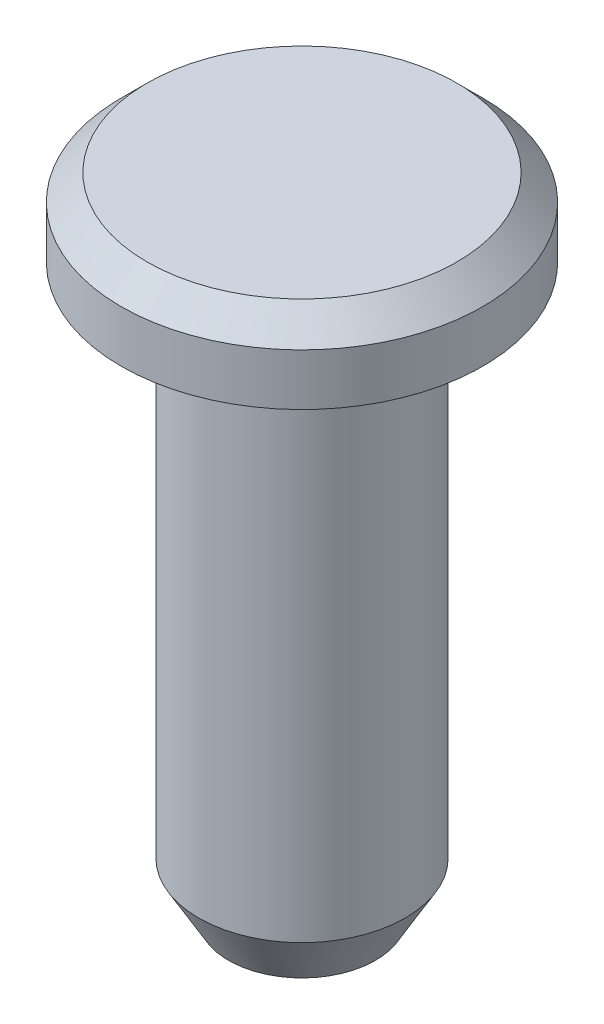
ISO-10303-21;
HEADER;
FILE_DESCRIPTION(('STEP AP214'),'2;1');
FILE_NAME('part.step','',(''),(''),'','','');
FILE_SCHEMA(('AUTOMOTIVE_DESIGN { 1 0 10303 214 1 1 1 1 }'));
ENDSEC;
DATA;
#1=APPLICATION_CONTEXT('core data for automotive mechanical design processes');
#2=APPLICATION_PROTOCOL_DEFINITION('international standard','automotive_design',2000,#1);
#3=PRODUCT_CONTEXT('',#1,'mechanical');
#4=PRODUCT('Part','Part','',(#3));
#5=PRODUCT_RELATED_PRODUCT_CATEGORY('part','',(#4));
#6=PRODUCT_DEFINITION_FORMATION('','',#4);
#7=PRODUCT_DEFINITION_CONTEXT('part definition',#1,'design');
#8=PRODUCT_DEFINITION('design','',#6,#7);
#9=PRODUCT_DEFINITION_SHAPE('','',#8);
#10=(LENGTH_UNIT() NAMED_UNIT(*) SI_UNIT(.MILLI.,.METRE.));
#11=(NAMED_UNIT(*) PLANE_ANGLE_UNIT() SI_UNIT($,.RADIAN.));
#12=(NAMED_UNIT(*) SI_UNIT($,.STERADIAN.) SOLID_ANGLE_UNIT());
#13=UNCERTAINTY_MEASURE_WITH_UNIT(LENGTH_MEASURE(1.E-05),#10,'distance_accuracy_value','');
#14=(GEOMETRIC_REPRESENTATION_CONTEXT(3) GLOBAL_UNCERTAINTY_ASSIGNED_CONTEXT((#13)) GLOBAL_UNIT_ASSIGNED_CONTEXT((#10,
#11,#12)) REPRESENTATION_CONTEXT('',''));
#15=CARTESIAN_POINT('',(0.,0.,0.));
#16=DIRECTION('',(0.,0.,1.));
#17=DIRECTION('',(1.,0.,0.));
#18=AXIS2_PLACEMENT_3D('',#15,#16,#17);
#19=CARTESIAN_POINT('',(0.,0.,0.));
#20=DIRECTION('',(0.,-1.,0.));
#21=DIRECTION('',(0.,0.,-1.));
#22=AXIS2_PLACEMENT_3D('',#19,#20,#21);
#23=PLANE('',#22);
#24=CARTESIAN_POINT('',(0.,0.,0.));
#25=DIRECTION('',(0.,-1.,0.));
#26=DIRECTION('',(0.,0.,-1.));
#27=AXIS2_PLACEMENT_3D('',#24,#25,#26);
#28=CIRCLE('',#27,2.84529946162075);
#29=CARTESIAN_POINT('',(0.,0.,-2.84529946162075));
#30=VERTEX_POINT('',#29);
#31=EDGE_CURVE('E10',#30,#30,#28,.T.);
#32=ORIENTED_EDGE('',*,*,#31,.T.);
#33=EDGE_LOOP('',(#32));
#34=FACE_BOUND('',#33,.T.);
#35=ADVANCED_FACE('F30',(#34),#23,.T.);
#36=CARTESIAN_POINT('',(0.,0.,0.));
#37=DIRECTION('',(0.,1.,0.));
#38=DIRECTION('',(0.,0.,1.));
#39=AXIS2_PLACEMENT_3D('',#36,#37,#38);
#40=CYLINDRICAL_SURFACE('',#39,4.);
#41=CARTESIAN_POINT('',(0.,2.00000000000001,0.));
#42=DIRECTION('',(0.,-1.,0.));
#43=DIRECTION('',(0.,0.,-1.));
#44=AXIS2_PLACEMENT_3D('',#41,#42,#43);
#45=CIRCLE('',#44,4.);
#46=CARTESIAN_POINT('',(0.,2.00000000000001,-4.));
#47=VERTEX_POINT('',#46);
#48=EDGE_CURVE('E37',#47,#47,#45,.F.);
#49=ORIENTED_EDGE('',*,*,#48,.T.);
#50=EDGE_LOOP('',(#49));
#51=FACE_BOUND('',#50,.T.);
#52=CARTESIAN_POINT('',(0.,22.,0.));
#53=DIRECTION('',(0.,1.,0.));
#54=DIRECTION('',(0.,0.,1.));
#55=AXIS2_PLACEMENT_3D('',#52,#53,#54);
#56=CIRCLE('',#55,4.);
#57=CARTESIAN_POINT('',(0.,22.,4.));
#58=VERTEX_POINT('',#57);
#59=EDGE_CURVE('E50',#58,#58,#56,.T.);
#60=ORIENTED_EDGE('',*,*,#59,.F.);
#61=EDGE_LOOP('',(#60));
#62=FACE_BOUND('',#61,.T.);
#63=ADVANCED_FACE('F61',(#51,#62),#40,.T.);
#64=CARTESIAN_POINT('',(-4.,22.,0.));
#65=DIRECTION('',(0.,-1.,0.));
#66=DIRECTION('',(0.,0.,-1.));
#67=AXIS2_PLACEMENT_3D('',#64,#65,#66);
#68=PLANE('',#67);
#69=ORIENTED_EDGE('',*,*,#59,.T.);
#70=EDGE_LOOP('',(#69));
#71=FACE_BOUND('',#70,.T.);
#72=CARTESIAN_POINT('',(0.,22.,0.));
#73=DIRECTION('',(0.,1.,0.));
#74=DIRECTION('',(0.,0.,1.));
#75=AXIS2_PLACEMENT_3D('',#72,#73,#74);
#76=CIRCLE('',#75,7.);
#77=CARTESIAN_POINT('',(0.,22.,7.));
#78=VERTEX_POINT('',#77);
#79=EDGE_CURVE('E53',#78,#78,#76,.T.);
#80=ORIENTED_EDGE('',*,*,#79,.F.);
#81=EDGE_LOOP('',(#80));
#82=FACE_BOUND('',#81,.T.);
#83=ADVANCED_FACE('F59',(#71,#82),#68,.T.);
#84=CARTESIAN_POINT('',(0.,0.,0.));
#85=DIRECTION('',(0.,1.,0.));
#86=DIRECTION('',(0.,0.,1.));
#87=AXIS2_PLACEMENT_3D('',#84,#85,#86);
#88=CYLINDRICAL_SURFACE('',#87,7.);
#89=CARTESIAN_POINT('',(0.,24.,0.));
#90=DIRECTION('',(0.,1.,0.));
#91=DIRECTION('',(0.,0.,1.));
#92=AXIS2_PLACEMENT_3D('',#89,#90,#91);
#93=CIRCLE('',#92,7.);
#94=CARTESIAN_POINT('',(0.,24.,7.));
#95=VERTEX_POINT('',#94);
#96=EDGE_CURVE('E41',#95,#95,#93,.F.);
#97=ORIENTED_EDGE('',*,*,#96,.T.);
#98=EDGE_LOOP('',(#97));
#99=FACE_BOUND('',#98,.T.);
#100=ORIENTED_EDGE('',*,*,#79,.T.);
#101=EDGE_LOOP('',(#100));
#102=FACE_BOUND('',#101,.T.);
#103=ADVANCED_FACE('F57',(#99,#102),#88,.T.);
#104=CARTESIAN_POINT('',(-7.,25.,0.));
#105=DIRECTION('',(0.,1.,0.));
#106=DIRECTION('',(0.,0.,1.));
#107=AXIS2_PLACEMENT_3D('',#104,#105,#106);
#108=PLANE('',#107);
#109=CARTESIAN_POINT('',(0.,25.,0.));
#110=DIRECTION('',(0.,1.,0.));
#111=DIRECTION('',(0.,0.,1.));
#112=AXIS2_PLACEMENT_3D('',#109,#110,#111);
#113=CIRCLE('',#112,6.00000000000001);
#114=CARTESIAN_POINT('',(0.,25.,6.00000000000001));
#115=VERTEX_POINT('',#114);
#116=EDGE_CURVE('E45',#115,#115,#113,.T.);
#117=ORIENTED_EDGE('',*,*,#116,.T.);
#118=EDGE_LOOP('',(#117));
#119=FACE_BOUND('',#118,.T.);
#120=ADVANCED_FACE('F68',(#119),#108,.T.);
#121=CARTESIAN_POINT('',(0.,25.,0.));
#122=DIRECTION('',(0.,-1.,0.));
#123=DIRECTION('',(0.,0.,-1.));
#124=AXIS2_PLACEMENT_3D('',#121,#122,#123);
#125=CONICAL_SURFACE('',#124,6.00000000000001,0.785398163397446);
#126=ORIENTED_EDGE('',*,*,#96,.F.);
#127=EDGE_LOOP('',(#126));
#128=FACE_BOUND('',#127,.T.);
#129=ORIENTED_EDGE('',*,*,#116,.F.);
#130=EDGE_LOOP('',(#129));
#131=FACE_BOUND('',#130,.T.);
#132=ADVANCED_FACE('F76',(#128,#131),#125,.T.);
#133=CARTESIAN_POINT('',(0.,2.00000000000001,0.));
#134=DIRECTION('',(0.,1.,0.));
#135=DIRECTION('',(0.,0.,1.));
#136=AXIS2_PLACEMENT_3D('',#133,#134,#135);
#137=CONICAL_SURFACE('',#136,4.,0.523598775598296);
#138=ORIENTED_EDGE('',*,*,#31,.F.);
#139=EDGE_LOOP('',(#138));
#140=FACE_BOUND('',#139,.T.);
#141=ORIENTED_EDGE('',*,*,#48,.F.);
#142=EDGE_LOOP('',(#141));
#143=FACE_BOUND('',#142,.T.);
#144=ADVANCED_FACE('F32',(#140,#143),#137,.T.);
#145=CLOSED_SHELL('',(#35,#63,#83,#103,#120,#132,#144));
#146=MANIFOLD_SOLID_BREP('B2',#145);
#147=ADVANCED_BREP_SHAPE_REPRESENTATION('',(#18,#146),#14);
#148=SHAPE_DEFINITION_REPRESENTATION(#9,#147);
ENDSEC;
END-ISO-10303-21;
